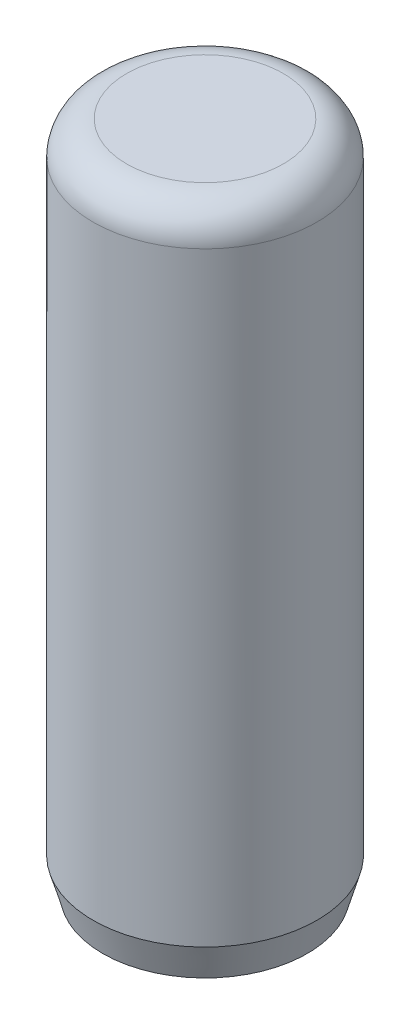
ISO-10303-21;
HEADER;
FILE_DESCRIPTION(('STEP AP214'),'2;1');
FILE_NAME('part.step','',(''),(''),'','','');
FILE_SCHEMA(('AUTOMOTIVE_DESIGN { 1 0 10303 214 1 1 1 1 }'));
ENDSEC;
DATA;
#1=APPLICATION_CONTEXT('core data for automotive mechanical design processes');
#2=APPLICATION_PROTOCOL_DEFINITION('international standard','automotive_design',2000,#1);
#3=PRODUCT_CONTEXT('',#1,'mechanical');
#4=PRODUCT('Part','Part','',(#3));
#5=PRODUCT_RELATED_PRODUCT_CATEGORY('part','',(#4));
#6=PRODUCT_DEFINITION_FORMATION('','',#4);
#7=PRODUCT_DEFINITION_CONTEXT('part definition',#1,'design');
#8=PRODUCT_DEFINITION('design','',#6,#7);
#9=PRODUCT_DEFINITION_SHAPE('','',#8);
#10=(LENGTH_UNIT() NAMED_UNIT(*) SI_UNIT(.MILLI.,.METRE.));
#11=(NAMED_UNIT(*) PLANE_ANGLE_UNIT() SI_UNIT($,.RADIAN.));
#12=(NAMED_UNIT(*) SI_UNIT($,.STERADIAN.) SOLID_ANGLE_UNIT());
#13=UNCERTAINTY_MEASURE_WITH_UNIT(LENGTH_MEASURE(1.E-05),#10,'distance_accuracy_value','');
#14=(GEOMETRIC_REPRESENTATION_CONTEXT(3) GLOBAL_UNCERTAINTY_ASSIGNED_CONTEXT((#13)) GLOBAL_UNIT_ASSIGNED_CONTEXT((#10,
#11,#12)) REPRESENTATION_CONTEXT('',''));
#15=CARTESIAN_POINT('',(0.,0.,0.));
#16=DIRECTION('',(0.,0.,1.));
#17=DIRECTION('',(1.,0.,0.));
#18=AXIS2_PLACEMENT_3D('',#15,#16,#17);
#19=CARTESIAN_POINT('',(6.35,38.1,0.));
#20=DIRECTION('',(0.,1.,0.));
#21=DIRECTION('',(0.,0.,1.));
#22=AXIS2_PLACEMENT_3D('',#19,#20,#21);
#23=PLANE('',#22);
#24=CARTESIAN_POINT('',(0.,38.1,0.));
#25=DIRECTION('',(0.,1.,0.));
#26=DIRECTION('',(0.,0.,1.));
#27=AXIS2_PLACEMENT_3D('',#24,#25,#26);
#28=CIRCLE('',#27,4.445);
#29=CARTESIAN_POINT('',(0.,38.1,4.445));
#30=VERTEX_POINT('',#29);
#31=EDGE_CURVE('E42',#30,#30,#28,.T.);
#32=ORIENTED_EDGE('',*,*,#31,.T.);
#33=EDGE_LOOP('',(#32));
#34=FACE_BOUND('',#33,.T.);
#35=ADVANCED_FACE('F31',(#34),#23,.T.);
#36=CARTESIAN_POINT('',(0.,0.,0.));
#37=DIRECTION('',(0.,-1.,0.));
#38=DIRECTION('',(0.,0.,-1.));
#39=AXIS2_PLACEMENT_3D('',#36,#37,#38);
#40=CYLINDRICAL_SURFACE('',#39,6.35);
#41=CARTESIAN_POINT('',(0.,1.905,0.));
#42=DIRECTION('',(0.,-1.,0.));
#43=DIRECTION('',(0.,0.,-1.));
#44=AXIS2_PLACEMENT_3D('',#41,#42,#43);
#45=CIRCLE('',#44,6.35);
#46=CARTESIAN_POINT('',(0.,1.905,-6.35));
#47=VERTEX_POINT('',#46);
#48=EDGE_CURVE('E10',#47,#47,#45,.F.);
#49=ORIENTED_EDGE('',*,*,#48,.T.);
#50=EDGE_LOOP('',(#49));
#51=FACE_BOUND('',#50,.T.);
#52=CARTESIAN_POINT('',(0.,36.195,0.));
#53=DIRECTION('',(0.,1.,0.));
#54=DIRECTION('',(0.,0.,1.));
#55=AXIS2_PLACEMENT_3D('',#52,#53,#54);
#56=CIRCLE('',#55,6.35);
#57=CARTESIAN_POINT('',(0.,36.195,6.35));
#58=VERTEX_POINT('',#57);
#59=EDGE_CURVE('E46',#58,#58,#56,.F.);
#60=ORIENTED_EDGE('',*,*,#59,.T.);
#61=EDGE_LOOP('',(#60));
#62=FACE_BOUND('',#61,.T.);
#63=ADVANCED_FACE('F52',(#51,#62),#40,.T.);
#64=CARTESIAN_POINT('',(0.,0.,0.));
#65=DIRECTION('',(0.,-1.,0.));
#66=DIRECTION('',(0.,0.,-1.));
#67=AXIS2_PLACEMENT_3D('',#64,#65,#66);
#68=PLANE('',#67);
#69=CARTESIAN_POINT('',(0.,0.,0.));
#70=DIRECTION('',(0.,-1.,0.));
#71=DIRECTION('',(0.,0.,-1.));
#72=AXIS2_PLACEMENT_3D('',#69,#70,#71);
#73=CIRCLE('',#72,5.80375004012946);
#74=CARTESIAN_POINT('',(0.,0.,-5.80375004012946));
#75=VERTEX_POINT('',#74);
#76=EDGE_CURVE('E38',#75,#75,#73,.T.);
#77=ORIENTED_EDGE('',*,*,#76,.T.);
#78=EDGE_LOOP('',(#77));
#79=FACE_BOUND('',#78,.T.);
#80=ADVANCED_FACE('F56',(#79),#68,.T.);
#81=CARTESIAN_POINT('',(0.,36.195,0.));
#82=DIRECTION('',(0.,1.,0.));
#83=DIRECTION('',(0.,0.,1.));
#84=AXIS2_PLACEMENT_3D('',#81,#82,#83);
#85=TOROIDAL_SURFACE('',#84,4.445,1.905);
#86=ORIENTED_EDGE('',*,*,#31,.F.);
#87=EDGE_LOOP('',(#86));
#88=FACE_BOUND('',#87,.T.);
#89=ORIENTED_EDGE('',*,*,#59,.F.);
#90=EDGE_LOOP('',(#89));
#91=FACE_BOUND('',#90,.T.);
#92=ADVANCED_FACE('F54',(#88,#91),#85,.T.);
#93=CARTESIAN_POINT('',(0.,0.,0.));
#94=DIRECTION('',(0.,1.,0.));
#95=DIRECTION('',(0.,0.,1.));
#96=AXIS2_PLACEMENT_3D('',#93,#94,#95);
#97=CONICAL_SURFACE('',#96,5.80375004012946,0.2792526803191);
#98=ORIENTED_EDGE('',*,*,#48,.F.);
#99=EDGE_LOOP('',(#98));
#100=FACE_BOUND('',#99,.T.);
#101=ORIENTED_EDGE('',*,*,#76,.F.);
#102=EDGE_LOOP('',(#101));
#103=FACE_BOUND('',#102,.T.);
#104=ADVANCED_FACE('F33',(#100,#103),#97,.T.);
#105=CLOSED_SHELL('',(#35,#63,#80,#92,#104));
#106=MANIFOLD_SOLID_BREP('B2',#105);
#107=ADVANCED_BREP_SHAPE_REPRESENTATION('',(#18,#106),#14);
#108=SHAPE_DEFINITION_REPRESENTATION(#9,#107);
ENDSEC;
END-ISO-10303-21;
